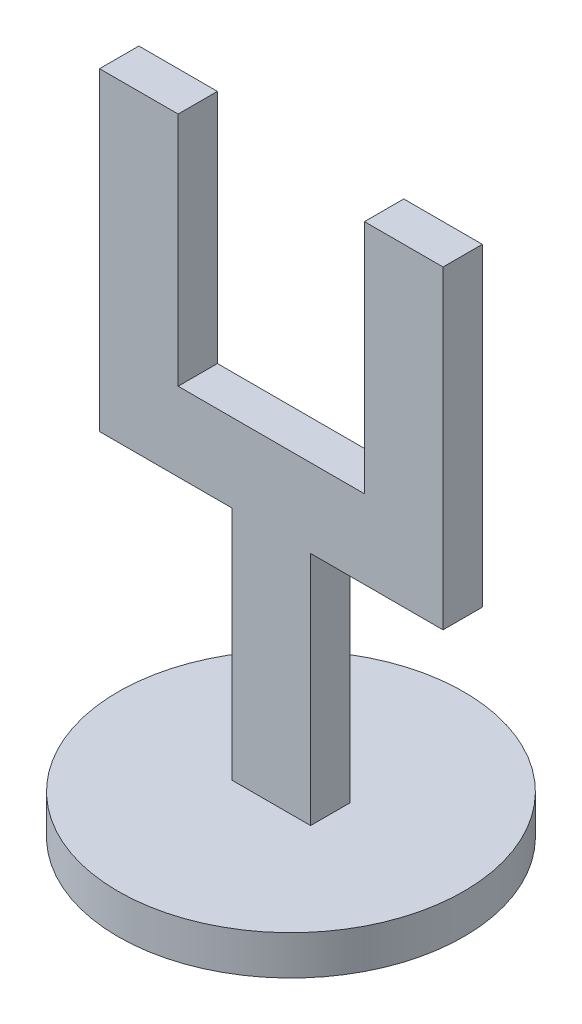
from build123d import *

# Parameters (mm, degrees)
SKETCH1_R           = 22
BOSS_EXTRUDE1_DEPTH = 5
SKETCH2_R           = 20.5
CUT_EXTRUDE1_DEPTH  = 2.5
SKETCH3_W           = 10
SKETCH3_H           = 5
BOSS_EXTRUDE2_DEPTH = 30
SKETCH4_W           = 43.714985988
SKETCH4_H           = 5
BOSS_EXTRUDE3_DEPTH = 10
SKETCH5_W           = 10
SKETCH5_H           = 5
BOSS_EXTRUDE4_DEPTH = 30


with BuildPart() as part:
    # Sketch1 → Boss-Extrude1 (new body)
    with BuildSketch(Plane(origin=(0, 0, 0), x_dir=(1, 0, 0), z_dir=(0, 1, 0))):
        with Locations(Location((0, 0, 0), (0, 0, 270))):
            Circle(SKETCH1_R)
    extrude(amount=BOSS_EXTRUDE1_DEPTH)

    # Sketch2 → Cut-Extrude1 (cut)
    with BuildSketch(Plane.XZ):
        with Locations(Location((0, 0, 0), (0, 0, 270))):
            Circle(SKETCH2_R)
    extrude(amount=-CUT_EXTRUDE1_DEPTH, mode=Mode.SUBTRACT)

    # Sketch3 → Boss-Extrude2 (add)
    with BuildSketch(Plane(origin=(0, 5, 0), x_dir=(1, 0, 0), z_dir=(0, 1, 0))):
        Rectangle(SKETCH3_W, SKETCH3_H)
    extrude(amount=BOSS_EXTRUDE2_DEPTH)

    # Sketch4 → Boss-Extrude3 (add)
    with BuildSketch(Plane(origin=(0, 35, 0), x_dir=(1, 0, 0), z_dir=(0, 1, 0))):
        Rectangle(SKETCH4_W, SKETCH4_H)
    extrude(amount=BOSS_EXTRUDE3_DEPTH)

    # Sketch5 → Boss-Extrude4 (add)
    with BuildSketch(Plane(origin=(0, 45, 0), x_dir=(1, 0, 0), z_dir=(0, 1, 0))):
        with Locations((16.857492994, 0)):
            Rectangle(SKETCH5_W, SKETCH5_H)
        with Locations((-16.857492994, 0)):
            Rectangle(SKETCH5_W, SKETCH5_H)
    extrude(amount=BOSS_EXTRUDE4_DEPTH)


solid = part.part
